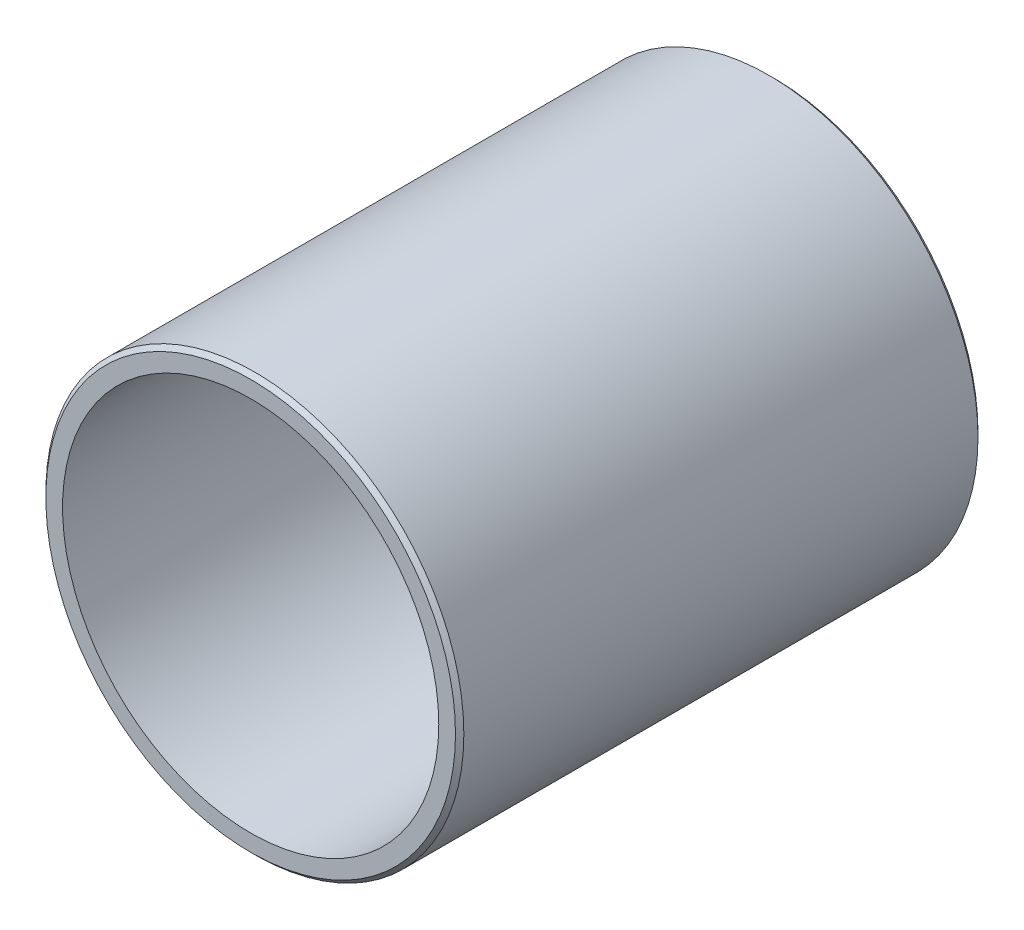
from build123d import *

# Parameters (mm, degrees)
ESQUISSE1_R          = 10
ESQUISSE1_R_2        = 9
BASE_EXTRUSION_DEPTH = 25
CHANFREIN1_SIZE      = 0.2


with BuildPart() as part:
    # Esquisse1 → Base-Extrusion (new body)
    with BuildSketch(Plane.XY):
        Circle(ESQUISSE1_R)
        Circle(ESQUISSE1_R_2, mode=Mode.SUBTRACT)
    extrude(amount=-BASE_EXTRUSION_DEPTH)

    # Chanfrein1
    chanfrein1_edges = [part.edges().sort_by_distance(p)[0] for p in [
        (-10, 0, 0),
        (-10, 0, -25),
    ]]
    chamfer(chanfrein1_edges, length=CHANFREIN1_SIZE)


solid = part.part
